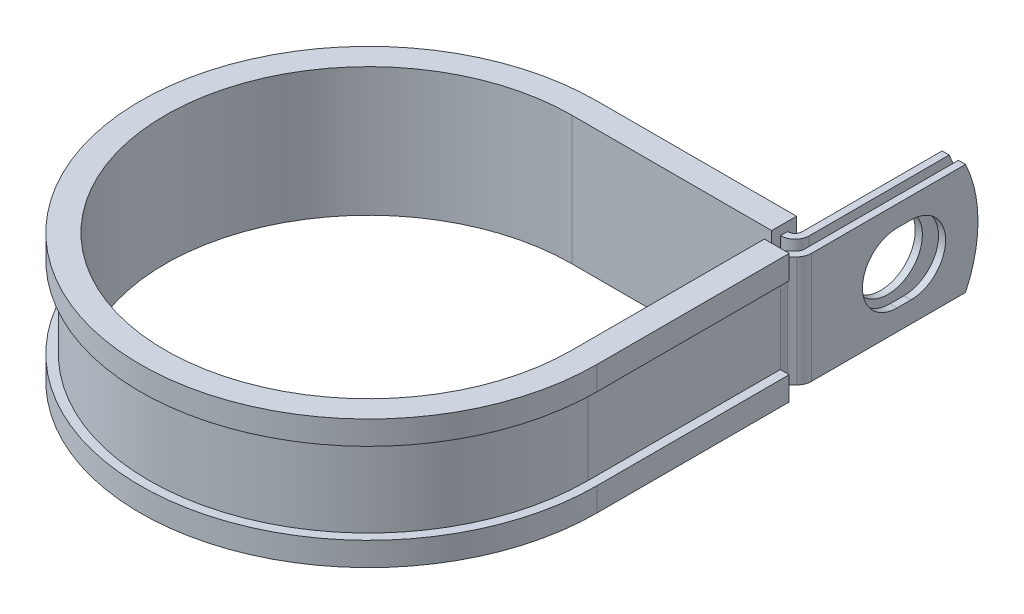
from build123d import *

# Parameters (mm, degrees)
EXTRUDE_THIN1_DEPTH = 9.525
SKETCH2_R           = 5.9436
CUT_EXTRUDE1_DEPTH  = 1.2192
CUT_EXTRUDE2_DEPTH  = 1.2192
CUT_EXTRUDE3_DEPTH  = 99.421144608


with BuildPart() as part:
    # Sketch1 → Extrude-Thin1 (new, symmetric)
    with BuildSketch(Plane(origin=(0, 0, 0), x_dir=(1, 0, 0), z_dir=(0, 1, 0))):
        with BuildLine():
            Line((38.3464698, 65.0748), (38.3464698, 36.449))
            ThreePointArc((38.3464698, 36.449), (38.253663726, 35.982432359), (37.989374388, 35.586895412))
            Line((37.989374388, 35.586895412), (37.163190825, 34.760711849))
            ThreePointArc((37.163190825, 34.760711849), (36.634612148, 33.969637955), (36.449, 33.036502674))
            Line((36.449, 33.036502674), (36.449, 0))
            ThreePointArc((36.449, 0), (-25.773335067, -25.773335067), (0, 36.449))
            Line((0, 36.449), (34.3332698, 36.449))
            ThreePointArc((34.3332698, 36.449), (36.057478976, 37.163190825), (36.7716698, 38.8874))
            Line((36.7716698, 38.8874), (36.7716698, 65.0748))
            Line((36.7716698, 65.0748), (35.5524698, 65.0748))
            Line((35.5524698, 65.0748), (35.5524698, 38.8874))
            ThreePointArc((35.5524698, 38.8874), (35.195374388, 38.025295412), (34.3332698, 37.6682))
            Line((34.3332698, 37.6682), (0, 37.6682))
            ThreePointArc((0, 37.6682), (-26.635439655, -26.635439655), (37.6682, 0))
            Line((37.6682, 0), (37.6682, 33.036502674))
            ThreePointArc((37.6682, 33.036502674), (37.761006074, 33.503070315), (38.025295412, 33.898607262))
            Line((38.025295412, 33.898607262), (38.851478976, 34.724790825))
            ThreePointArc((38.851478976, 34.724790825), (39.380057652, 35.515864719), (39.5656698, 36.449))
            Line((39.5656698, 36.449), (39.5656698, 65.0748))
            Line((39.5656698, 65.0748), (38.3464698, 65.0748))
        make_face()
    extrude(amount=EXTRUDE_THIN1_DEPTH, both=True)

    # Sketch2 → Cut-Extrude1 (cut)
    with BuildSketch(Plane.ZY.offset(-35.5524698)):
        with Locations((-52.3748, 0)):
            Circle(SKETCH2_R)
    extrude(amount=-CUT_EXTRUDE1_DEPTH, mode=Mode.SUBTRACT)

    # Sketch3 → Cut-Extrude2 (cut)
    with BuildSketch(Plane(origin=(39.5656698, 0, 0), x_dir=(0, 0, -1), z_dir=(1, 0, 0))):
        with BuildLine():
            Line((51.181, 5.9436), (53.5686, 5.9436))
            ThreePointArc((53.5686, 5.9436), (59.5122, 0), (53.5686, -5.9436))
            Line((53.5686, -5.9436), (51.181, -5.9436))
            ThreePointArc((51.181, -5.9436), (45.2374, 0), (51.181, 5.9436))
        make_face()
    extrude(amount=-CUT_EXTRUDE2_DEPTH, mode=Mode.SUBTRACT)

    # Sketch4 → Cut-Extrude3 (cut, through all)
    with BuildSketch(Plane.ZY.offset(-35.5524698)):
        with BuildLine():
            Line((-62.930263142, 9.525), (-65.0748, 9.525))
            Line((-65.0748, 9.525), (-65.0748, -2.21e-07))
            ThreePointArc((-65.0748, -2.21e-07), (-64.532038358, 4.881717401), (-62.930263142, 9.525))
        make_face()
        with BuildLine():
            ThreePointArc((-62.930263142, -9.525), (-64.53203831, -4.881717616), (-65.0748, -2.21e-07))
            Line((-65.0748, -2.21e-07), (-65.0748, -9.525))
            Line((-65.0748, -9.525), (-62.930263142, -9.525))
        make_face()
    extrude(amount=-CUT_EXTRUDE3_DEPTH, mode=Mode.SUBTRACT)

    # Sweep1: sweep along a path in Sketch6
    with BuildLine(Plane(origin=(0, 9.525, 0), x_dir=(1, 0, 0), z_dir=(0, 1, 0))) as sweep1_path:
        Line((34.925, 33.036502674), (34.925, 0))
        ThreePointArc((34.925, 0), (-24.695704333, -24.695704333), (0, 34.925))
        Line((0, 34.925), (34.2824698, 34.925))
    # Sketch5 → Sweep1 (sweep)
    with BuildSketch(Plane(origin=(0, 0, -33.036502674), x_dir=(-1, 0, 0), z_dir=(0, 0, -1))):
        Polygon((-37.6682, 9.525), (-36.449, 9.525), (-36.449, -9.525), (-37.6682, -9.525), (-37.6682, -6.985), (-39.1922, -6.985), (-39.1922, -11.049), (-34.925, -11.049), (-34.925, 11.049), (-39.1922, 11.049), (-39.1922, 6.985), (-37.6682, 6.985), align=None)
    sweep(path=sweep1_path.line)


solid = part.part
